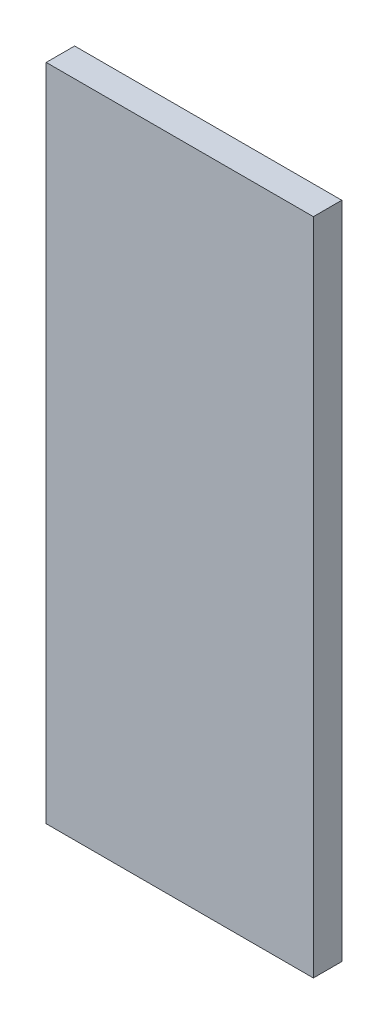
from build123d import *

# Parameters (mm, degrees)
SKETCH1_W           = 47
SKETCH1_H           = 116
BOSS_EXTRUDE1_DEPTH = 5


with BuildPart() as part:
    # Sketch1 → Boss-Extrude1 (new body)
    with BuildSketch(Plane.XY):
        with Locations((-23.5, -1212)):
            Rectangle(SKETCH1_W, SKETCH1_H)
    extrude(amount=BOSS_EXTRUDE1_DEPTH)


solid = part.part
